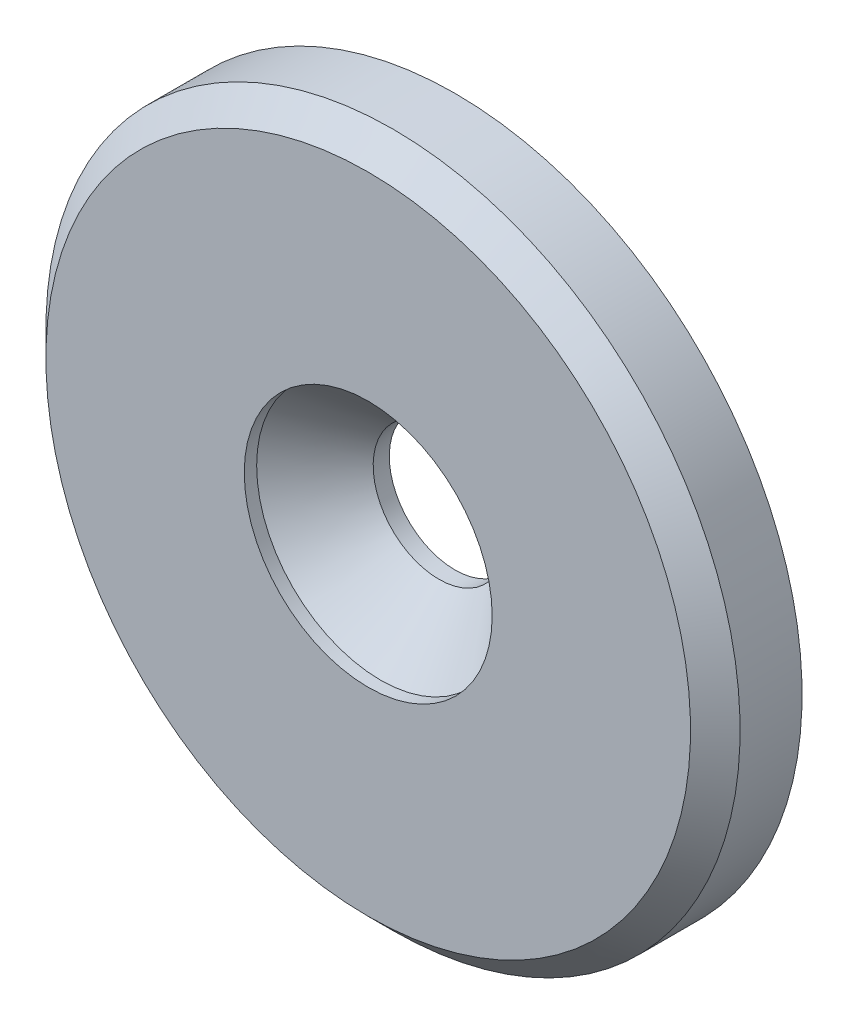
ISO-10303-21;
HEADER;
FILE_DESCRIPTION(('STEP AP214'),'2;1');
FILE_NAME('part.step','',(''),(''),'','','');
FILE_SCHEMA(('AUTOMOTIVE_DESIGN { 1 0 10303 214 1 1 1 1 }'));
ENDSEC;
DATA;
#1=APPLICATION_CONTEXT('core data for automotive mechanical design processes');
#2=APPLICATION_PROTOCOL_DEFINITION('international standard','automotive_design',2000,#1);
#3=PRODUCT_CONTEXT('',#1,'mechanical');
#4=PRODUCT('Part','Part','',(#3));
#5=PRODUCT_RELATED_PRODUCT_CATEGORY('part','',(#4));
#6=PRODUCT_DEFINITION_FORMATION('','',#4);
#7=PRODUCT_DEFINITION_CONTEXT('part definition',#1,'design');
#8=PRODUCT_DEFINITION('design','',#6,#7);
#9=PRODUCT_DEFINITION_SHAPE('','',#8);
#10=(LENGTH_UNIT() NAMED_UNIT(*) SI_UNIT(.MILLI.,.METRE.));
#11=(NAMED_UNIT(*) PLANE_ANGLE_UNIT() SI_UNIT($,.RADIAN.));
#12=(NAMED_UNIT(*) SI_UNIT($,.STERADIAN.) SOLID_ANGLE_UNIT());
#13=UNCERTAINTY_MEASURE_WITH_UNIT(LENGTH_MEASURE(1.E-05),#10,'distance_accuracy_value','');
#14=(GEOMETRIC_REPRESENTATION_CONTEXT(3) GLOBAL_UNCERTAINTY_ASSIGNED_CONTEXT((#13)) GLOBAL_UNIT_ASSIGNED_CONTEXT((#10,
#11,#12)) REPRESENTATION_CONTEXT('',''));
#15=CARTESIAN_POINT('',(0.,0.,0.));
#16=DIRECTION('',(0.,0.,1.));
#17=DIRECTION('',(1.,0.,0.));
#18=AXIS2_PLACEMENT_3D('',#15,#16,#17);
#19=CARTESIAN_POINT('',(0.,0.,0.65));
#20=DIRECTION('',(0.,0.,1.));
#21=DIRECTION('',(0.,-1.,0.));
#22=AXIS2_PLACEMENT_3D('',#19,#20,#21);
#23=CONICAL_SURFACE('',#22,2.65,0.785398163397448);
#24=CARTESIAN_POINT('',(0.,0.,3.));
#25=DIRECTION('',(0.,0.,1.));
#26=DIRECTION('',(0.,-1.,0.));
#27=AXIS2_PLACEMENT_3D('',#24,#25,#26);
#28=CIRCLE('',#27,5.);
#29=CARTESIAN_POINT('',(0.,-5.,3.));
#30=VERTEX_POINT('',#29);
#31=EDGE_CURVE('E37',#30,#30,#28,.T.);
#32=ORIENTED_EDGE('',*,*,#31,.T.);
#33=EDGE_LOOP('',(#32));
#34=FACE_BOUND('',#33,.T.);
#35=CARTESIAN_POINT('',(0.,0.,0.65));
#36=DIRECTION('',(0.,0.,1.));
#37=DIRECTION('',(0.,-1.,0.));
#38=AXIS2_PLACEMENT_3D('',#35,#36,#37);
#39=CIRCLE('',#38,2.65);
#40=CARTESIAN_POINT('',(0.,-2.65,0.65));
#41=VERTEX_POINT('',#40);
#42=EDGE_CURVE('E8',#41,#41,#39,.T.);
#43=ORIENTED_EDGE('',*,*,#42,.F.);
#44=EDGE_LOOP('',(#43));
#45=FACE_BOUND('',#44,.T.);
#46=ADVANCED_FACE('F12',(#34,#45),#23,.F.);
#47=CARTESIAN_POINT('',(0.,0.,3.91403502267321));
#48=DIRECTION('',(0.,0.,1.));
#49=DIRECTION('',(0.,-1.,0.));
#50=AXIS2_PLACEMENT_3D('',#47,#48,#49);
#51=CYLINDRICAL_SURFACE('',#50,2.65);
#52=ORIENTED_EDGE('',*,*,#42,.T.);
#53=EDGE_LOOP('',(#52));
#54=FACE_BOUND('',#53,.T.);
#55=CARTESIAN_POINT('',(0.,0.,0.));
#56=DIRECTION('',(0.,0.,1.));
#57=DIRECTION('',(0.,-1.,0.));
#58=AXIS2_PLACEMENT_3D('',#55,#56,#57);
#59=CIRCLE('',#58,2.65);
#60=CARTESIAN_POINT('',(0.,-2.65,0.));
#61=VERTEX_POINT('',#60);
#62=EDGE_CURVE('E18',#61,#61,#59,.T.);
#63=ORIENTED_EDGE('',*,*,#62,.F.);
#64=EDGE_LOOP('',(#63));
#65=FACE_BOUND('',#64,.T.);
#66=ADVANCED_FACE('F57',(#54,#65),#51,.F.);
#67=CARTESIAN_POINT('',(-2.65,0.,0.));
#68=DIRECTION('',(0.,0.,-1.));
#69=DIRECTION('',(0.,1.,0.));
#70=AXIS2_PLACEMENT_3D('',#67,#68,#69);
#71=PLANE('',#70);
#72=ORIENTED_EDGE('',*,*,#62,.T.);
#73=EDGE_LOOP('',(#72));
#74=FACE_BOUND('',#73,.T.);
#75=CARTESIAN_POINT('',(0.,0.,0.));
#76=DIRECTION('',(0.,0.,1.));
#77=DIRECTION('',(0.,-1.,0.));
#78=AXIS2_PLACEMENT_3D('',#75,#76,#77);
#79=CIRCLE('',#78,14.);
#80=CARTESIAN_POINT('',(0.,-14.,0.));
#81=VERTEX_POINT('',#80);
#82=EDGE_CURVE('E22',#81,#81,#79,.T.);
#83=ORIENTED_EDGE('',*,*,#82,.F.);
#84=EDGE_LOOP('',(#83));
#85=FACE_BOUND('',#84,.T.);
#86=ADVANCED_FACE('F62',(#74,#85),#71,.T.);
#87=CARTESIAN_POINT('',(0.,0.,3.91403502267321));
#88=DIRECTION('',(0.,0.,1.));
#89=DIRECTION('',(0.,-1.,0.));
#90=AXIS2_PLACEMENT_3D('',#87,#88,#89);
#91=CYLINDRICAL_SURFACE('',#90,14.);
#92=ORIENTED_EDGE('',*,*,#82,.T.);
#93=EDGE_LOOP('',(#92));
#94=FACE_BOUND('',#93,.T.);
#95=CARTESIAN_POINT('',(0.,0.,2.5));
#96=DIRECTION('',(0.,0.,1.));
#97=DIRECTION('',(0.,-1.,0.));
#98=AXIS2_PLACEMENT_3D('',#95,#96,#97);
#99=CIRCLE('',#98,14.);
#100=CARTESIAN_POINT('',(0.,-14.,2.5));
#101=VERTEX_POINT('',#100);
#102=EDGE_CURVE('E26',#101,#101,#99,.T.);
#103=ORIENTED_EDGE('',*,*,#102,.F.);
#104=EDGE_LOOP('',(#103));
#105=FACE_BOUND('',#104,.T.);
#106=ADVANCED_FACE('F67',(#94,#105),#91,.T.);
#107=CARTESIAN_POINT('',(0.,0.,3.5));
#108=DIRECTION('',(0.,0.,-1.));
#109=DIRECTION('',(0.,1.,0.));
#110=AXIS2_PLACEMENT_3D('',#107,#108,#109);
#111=CONICAL_SURFACE('',#110,13.,0.785398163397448);
#112=ORIENTED_EDGE('',*,*,#102,.T.);
#113=EDGE_LOOP('',(#112));
#114=FACE_BOUND('',#113,.T.);
#115=CARTESIAN_POINT('',(0.,0.,3.5));
#116=DIRECTION('',(0.,0.,1.));
#117=DIRECTION('',(0.,-1.,0.));
#118=AXIS2_PLACEMENT_3D('',#115,#116,#117);
#119=CIRCLE('',#118,13.);
#120=CARTESIAN_POINT('',(0.,-13.,3.5));
#121=VERTEX_POINT('',#120);
#122=EDGE_CURVE('E31',#121,#121,#119,.T.);
#123=ORIENTED_EDGE('',*,*,#122,.F.);
#124=EDGE_LOOP('',(#123));
#125=FACE_BOUND('',#124,.T.);
#126=ADVANCED_FACE('F53',(#114,#125),#111,.T.);
#127=CARTESIAN_POINT('',(-5.,0.,3.5));
#128=DIRECTION('',(0.,0.,1.));
#129=DIRECTION('',(0.,-1.,0.));
#130=AXIS2_PLACEMENT_3D('',#127,#128,#129);
#131=PLANE('',#130);
#132=ORIENTED_EDGE('',*,*,#122,.T.);
#133=EDGE_LOOP('',(#132));
#134=FACE_BOUND('',#133,.T.);
#135=CARTESIAN_POINT('',(0.,0.,3.5));
#136=DIRECTION('',(0.,0.,1.));
#137=DIRECTION('',(0.,-1.,0.));
#138=AXIS2_PLACEMENT_3D('',#135,#136,#137);
#139=CIRCLE('',#138,5.);
#140=CARTESIAN_POINT('',(0.,-5.,3.5));
#141=VERTEX_POINT('',#140);
#142=EDGE_CURVE('E34',#141,#141,#139,.T.);
#143=ORIENTED_EDGE('',*,*,#142,.F.);
#144=EDGE_LOOP('',(#143));
#145=FACE_BOUND('',#144,.T.);
#146=ADVANCED_FACE('F45',(#134,#145),#131,.T.);
#147=CARTESIAN_POINT('',(0.,0.,3.91403502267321));
#148=DIRECTION('',(0.,0.,1.));
#149=DIRECTION('',(0.,-1.,0.));
#150=AXIS2_PLACEMENT_3D('',#147,#148,#149);
#151=CYLINDRICAL_SURFACE('',#150,5.);
#152=ORIENTED_EDGE('',*,*,#142,.T.);
#153=EDGE_LOOP('',(#152));
#154=FACE_BOUND('',#153,.T.);
#155=ORIENTED_EDGE('',*,*,#31,.F.);
#156=EDGE_LOOP('',(#155));
#157=FACE_BOUND('',#156,.T.);
#158=ADVANCED_FACE('F43',(#154,#157),#151,.F.);
#159=CLOSED_SHELL('',(#46,#66,#86,#106,#126,#146,#158));
#160=MANIFOLD_SOLID_BREP('B1',#159);
#161=ADVANCED_BREP_SHAPE_REPRESENTATION('',(#18,#160),#14);
#162=SHAPE_DEFINITION_REPRESENTATION(#9,#161);
ENDSEC;
END-ISO-10303-21;
